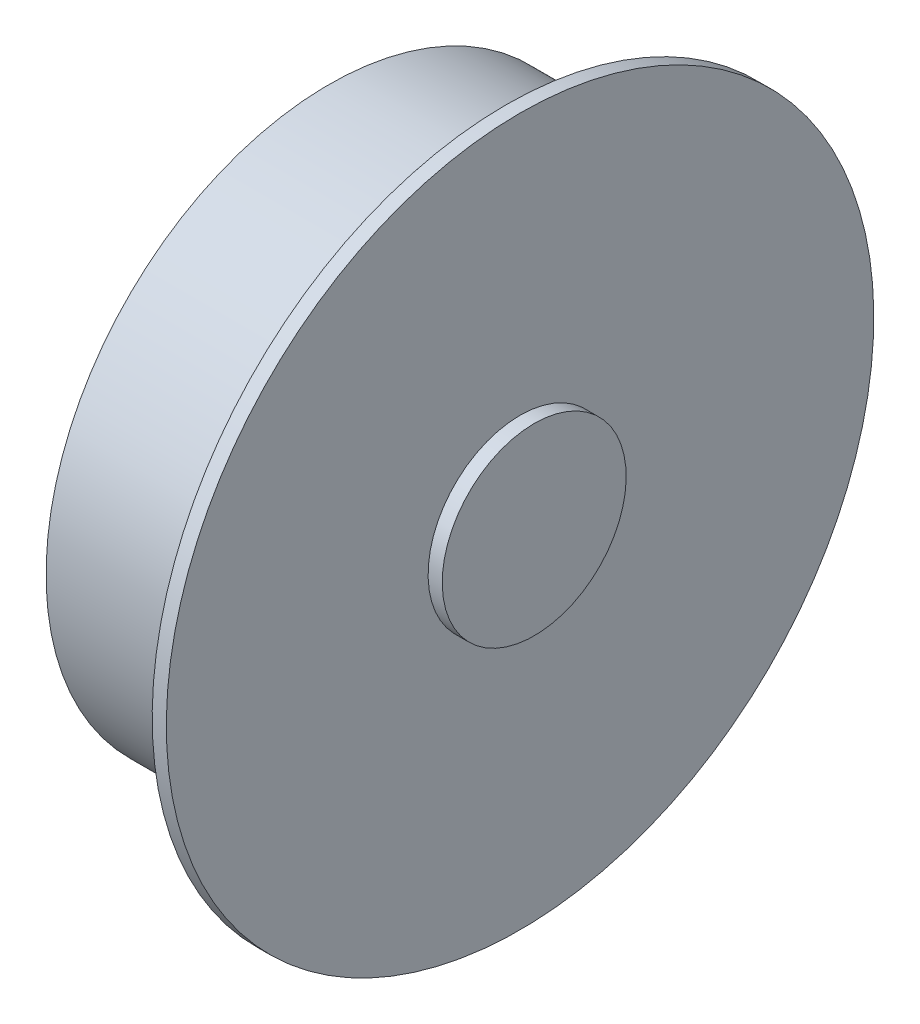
from build123d import *

# Parameters (mm, degrees)
CROQUIS114_R            = 40
SALIENTE_EXTRUIR1_DEPTH = 25
REDONDEO1_R             = 1
CROQUIS115_R            = 50
SALIENTE_EXTRUIR2_DEPTH = 2
CROQUIS122_R            = 13
SALIENTE_EXTRUIR3_DEPTH = 2


with BuildPart() as part:
    # Croquis114 → Saliente-Extruir1 (new body)
    with BuildSketch(Plane(origin=(0, 0, 0), x_dir=(0, 0, -1), z_dir=(1, 0, 0))):
        Circle(CROQUIS114_R)
    extrude(amount=-SALIENTE_EXTRUIR1_DEPTH)

    # Redondeo1
    redondeo1_edges = [part.edges().sort_by_distance(p)[0] for p in [
        (0, 0, 40),
    ]]
    fillet(redondeo1_edges, radius=REDONDEO1_R)

    # Croquis115 → Saliente-Extruir2 (add)
    with BuildSketch(Plane(origin=(0, 0, 0), x_dir=(0, 0, -1), z_dir=(1, 0, 0))):
        with Locations(Location((0, 0, 0), (0, 0, 90))):
            Circle(CROQUIS115_R)
    extrude(amount=SALIENTE_EXTRUIR2_DEPTH)


with BuildPart() as body_2:
    # Croquis122 → Saliente-Extruir3 (new body)
    with BuildSketch(Plane(origin=(2, 0, 0), x_dir=(0, 0, -1), z_dir=(1, 0, 0))):
        with Locations(Location((0, 0, 0), (0, 0, 90))):
            Circle(CROQUIS122_R)
    extrude(amount=SALIENTE_EXTRUIR3_DEPTH)


solid = Compound([part.part, body_2.part])
